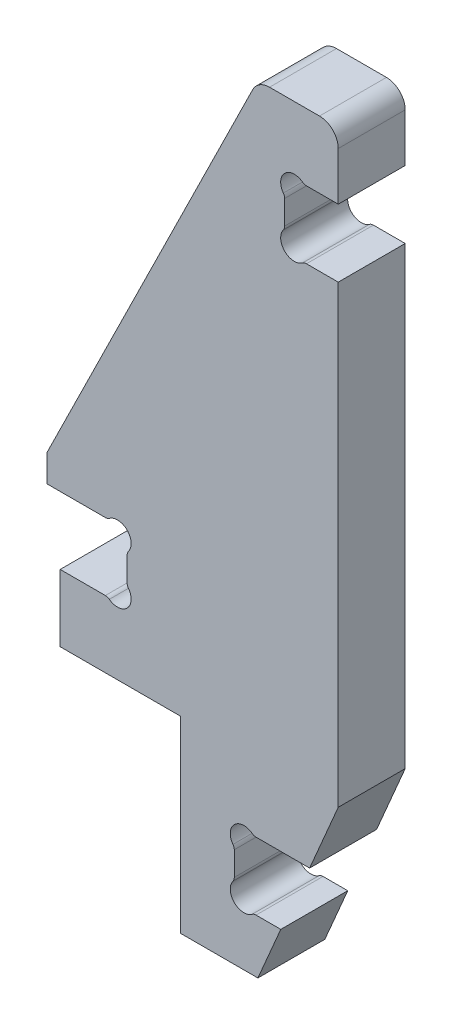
from build123d import *

# Parameters (mm, degrees)
BOSS_EXTRU_2_DEPTH = 25
CONG_1_R           = 7


with BuildPart() as part:
    # Esquisse2 → Boss.-Extru.2 (new body)
    with BuildSketch(Plane.XY):
        with BuildLine():
            Line((58.814801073, 240), (46.945841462, 240))
            ThreePointArc((46.945841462, 240), (46.16212682, 239.873982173), (45.45742179, 239.508633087))
            ThreePointArc((45.45742179, 239.508633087), (38.814801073, 240), (38.32343416, 246.642620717))
            ThreePointArc((38.32343416, 246.642620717), (38.688783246, 247.347325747), (38.814801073, 248.131040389))
            Line((38.814801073, 248.131040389), (38.814801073, 257.068959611))
            ThreePointArc((38.814801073, 257.068959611), (38.688783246, 257.852674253), (38.32343416, 258.557379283))
            ThreePointArc((38.32343416, 258.557379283), (38.814801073, 265.2), (45.45742179, 265.691366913))
            ThreePointArc((45.45742179, 265.691366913), (46.16212682, 265.326017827), (46.945841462, 265.2))
            Line((46.945841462, 265.2), (58.814801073, 265.2))
            Line((58.814801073, 265.2), (58.814801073, 290.2))
            Line((58.814801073, 290.2), (28.814801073, 290.2))
            Line((28.814801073, 290.2), (-50, 130.4))
            Line((-50, 130.4), (-50, 120.4))
            Line((-50, 120.4), (-28.131040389, 120.4))
            ThreePointArc((-28.131040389, 120.4), (-27.347325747, 120.526017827), (-26.642620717, 120.891366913))
            ThreePointArc((-26.642620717, 120.891366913), (-20, 120.4), (-19.508633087, 113.757379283))
            ThreePointArc((-19.508633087, 113.757379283), (-19.873982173, 113.052674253), (-20, 112.268959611))
            Line((-20, 112.268959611), (-20, 103.331040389))
            ThreePointArc((-20, 103.331040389), (-19.873982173, 102.547325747), (-19.508633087, 101.842620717))
            ThreePointArc((-19.508633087, 101.842620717), (-20, 95.2), (-26.642620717, 94.708633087))
            ThreePointArc((-26.642620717, 94.708633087), (-27.347325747, 95.073982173), (-28.131040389, 95.2))
            Line((-28.131040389, 95.2), (-45, 95.2))
            Line((-45, 95.2), (-45, 70.2))
            Line((-45, 70.2), (0, 70.2))
            Line((0, 70.2), (0, 0))
            Line((0, 0), (28.814801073, 0))
            Line((28.814801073, 0), (37.36180962, 20))
            Line((37.36180962, 20), (28.131040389, 20))
            ThreePointArc((28.131040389, 20), (27.347325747, 19.873982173), (26.642620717, 19.508633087))
            ThreePointArc((26.642620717, 19.508633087), (20, 20), (19.508633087, 26.642620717))
            ThreePointArc((19.508633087, 26.642620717), (19.873982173, 27.347325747), (20, 28.131040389))
            Line((20, 28.131040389), (20, 37.068959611))
            ThreePointArc((20, 37.068959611), (19.873982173, 37.852674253), (19.508633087, 38.557379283))
            ThreePointArc((19.508633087, 38.557379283), (20, 45.2), (26.642620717, 45.691366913))
            ThreePointArc((26.642620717, 45.691366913), (27.347325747, 45.326017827), (28.131040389, 45.2))
            Line((28.131040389, 45.2), (48.131040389, 45.2))
            Line((48.131040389, 45.2), (58.814801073, 70.2))
            Line((58.814801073, 70.2), (58.814801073, 240))
        make_face()
    extrude(amount=BOSS_EXTRU_2_DEPTH)

    # Cong_1
    cong_1_edges = [part.edges().sort_by_distance(p)[0] for p in [
        (28.814801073, 290.2, 12.5),
        (58.814801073, 290.2, 12.5),
    ]]
    fillet(cong_1_edges, radius=CONG_1_R)


solid = part.part
